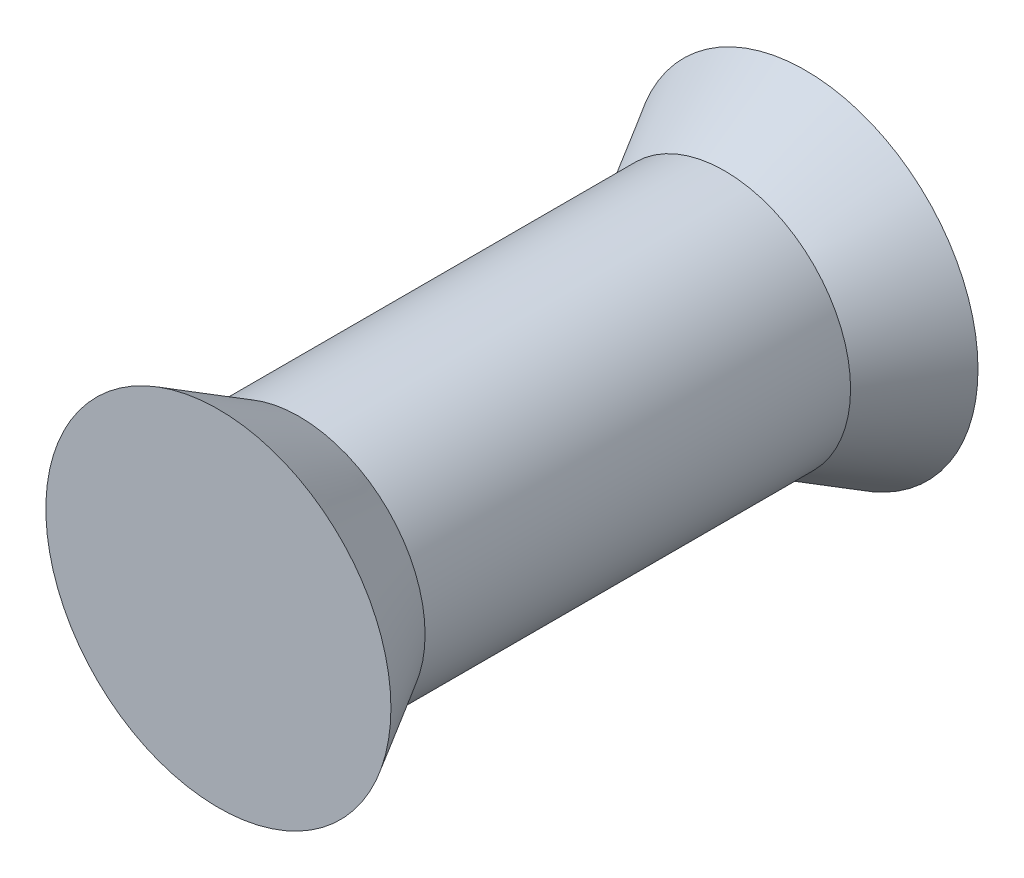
from build123d import *


with BuildPart() as part:
    # Sketch 1 → Revolve 1 (revolve)
    with BuildSketch(Plane(origin=(0, 0, 0), x_dir=(0, 0, -1), z_dir=(1, 0, 0)), mode=Mode.PRIVATE) as revolve_1_sk:
        Polygon((0, 3.25478181), (0, 0), (11.0744, 0), (11.0744, 3.25478181), (9.5504, 2.3749), (1.524, 2.3749), align=None)
    revolve(revolve_1_sk.sketch.rotate(Axis((0, 0, 0), (0, 0, -1)), 90), axis=Axis((0, 0, 0), (0, 0, -1)))


solid = part.part
